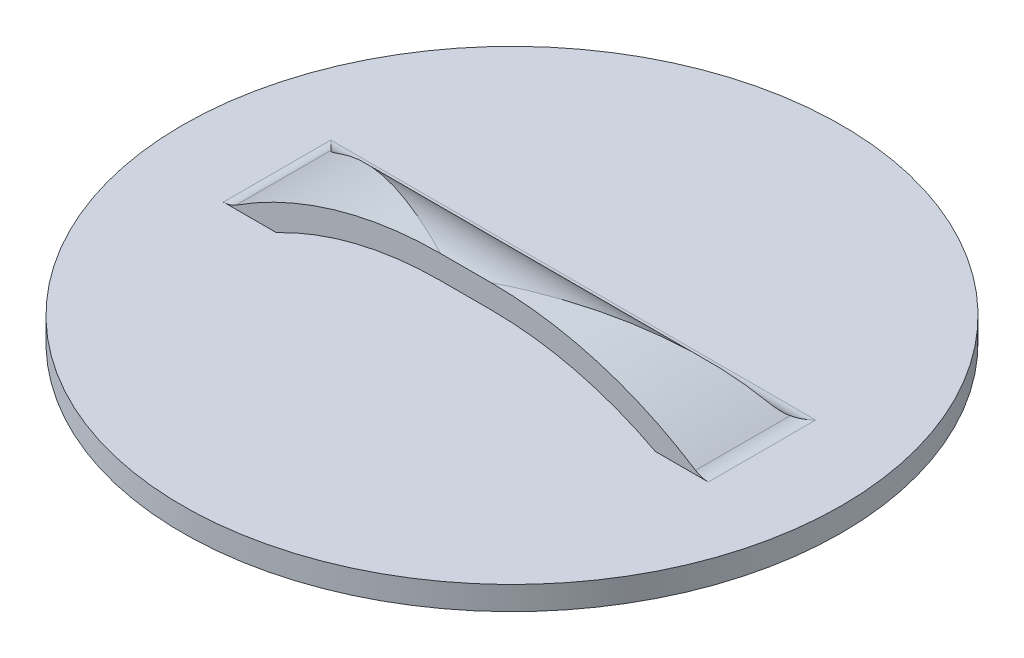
ISO-10303-21;
HEADER;
FILE_DESCRIPTION(('STEP AP214'),'2;1');
FILE_NAME('part.step','',(''),(''),'','','');
FILE_SCHEMA(('AUTOMOTIVE_DESIGN { 1 0 10303 214 1 1 1 1 }'));
ENDSEC;
DATA;
#1=APPLICATION_CONTEXT('core data for automotive mechanical design processes');
#2=APPLICATION_PROTOCOL_DEFINITION('international standard','automotive_design',2000,#1);
#3=PRODUCT_CONTEXT('',#1,'mechanical');
#4=PRODUCT('Part','Part','',(#3));
#5=PRODUCT_RELATED_PRODUCT_CATEGORY('part','',(#4));
#6=PRODUCT_DEFINITION_FORMATION('','',#4);
#7=PRODUCT_DEFINITION_CONTEXT('part definition',#1,'design');
#8=PRODUCT_DEFINITION('design','',#6,#7);
#9=PRODUCT_DEFINITION_SHAPE('','',#8);
#10=(LENGTH_UNIT() NAMED_UNIT(*) SI_UNIT(.MILLI.,.METRE.));
#11=(NAMED_UNIT(*) PLANE_ANGLE_UNIT() SI_UNIT($,.RADIAN.));
#12=(NAMED_UNIT(*) SI_UNIT($,.STERADIAN.) SOLID_ANGLE_UNIT());
#13=UNCERTAINTY_MEASURE_WITH_UNIT(LENGTH_MEASURE(1.E-05),#10,'distance_accuracy_value','');
#14=(GEOMETRIC_REPRESENTATION_CONTEXT(3) GLOBAL_UNCERTAINTY_ASSIGNED_CONTEXT((#13)) GLOBAL_UNIT_ASSIGNED_CONTEXT((#10,
#11,#12)) REPRESENTATION_CONTEXT('',''));
#15=CARTESIAN_POINT('',(0.,0.,0.));
#16=DIRECTION('',(0.,0.,1.));
#17=DIRECTION('',(1.,0.,0.));
#18=AXIS2_PLACEMENT_3D('',#15,#16,#17);
#19=CARTESIAN_POINT('',(-3.4163,-38.9867681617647,12.7));
#20=DIRECTION('',(0.,0.,-1.));
#21=DIRECTION('',(-1.,0.,0.));
#22=AXIS2_PLACEMENT_3D('',#19,#20,#21);
#23=CYLINDRICAL_SURFACE('',#22,47.6227681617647);
#24=CARTESIAN_POINT('',(-3.4163,-38.9867681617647,12.7));
#25=DIRECTION('',(0.,0.,1.));
#26=DIRECTION('',(1.,0.,0.));
#27=AXIS2_PLACEMENT_3D('',#24,#25,#26);
#28=CIRCLE('',#27,47.6227681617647);
#29=CARTESIAN_POINT('',(-3.4163,8.636,12.7));
#30=VERTEX_POINT('',#29);
#31=CARTESIAN_POINT('',(-25.559320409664,3.17499999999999,12.7));
#32=VERTEX_POINT('',#31);
#33=EDGE_CURVE('E138',#30,#32,#28,.T.);
#34=ORIENTED_EDGE('',*,*,#33,.T.);
#35=DIRECTION('',(0.,0.,-1.));
#36=VECTOR('',#35,1.);
#37=CARTESIAN_POINT('',(-25.559320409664,3.17499999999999,12.7));
#38=LINE('',#37,#36);
#39=CARTESIAN_POINT('',(-25.559320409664,3.175,3.72143443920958));
#40=VERTEX_POINT('',#39);
#41=EDGE_CURVE('E121',#32,#40,#38,.T.);
#42=ORIENTED_EDGE('',*,*,#41,.T.);
#43=CARTESIAN_POINT('',(-30.7651565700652,0.,2.69678471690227));
#44=CARTESIAN_POINT('',(-30.4142280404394,0.246182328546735,2.733123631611));
#45=CARTESIAN_POINT('',(-30.0606087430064,0.487164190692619,2.77792436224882));
#46=CARTESIAN_POINT('',(-29.3487082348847,0.958447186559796,2.8828807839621));
#47=CARTESIAN_POINT('',(-28.9904284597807,1.18875151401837,2.94303184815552));
#48=CARTESIAN_POINT('',(-28.2703423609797,1.63815632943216,3.07702719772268));
#49=CARTESIAN_POINT('',(-27.9085432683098,1.85727563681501,3.15084744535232));
#50=CARTESIAN_POINT('',(-27.1812932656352,2.28466350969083,3.3109146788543));
#51=CARTESIAN_POINT('',(-26.8158420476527,2.49293115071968,3.39716272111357));
#52=CARTESIAN_POINT('',(-25.7183043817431,3.09939298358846,3.67178987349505));
#53=CARTESIAN_POINT('',(-24.9813955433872,3.48151144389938,3.87675323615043));
#54=CARTESIAN_POINT('',(-23.4973314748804,4.20306506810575,4.32289835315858));
#55=CARTESIAN_POINT('',(-22.7501701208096,4.54247336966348,4.56410269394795));
#56=CARTESIAN_POINT('',(-21.3995448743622,5.11487623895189,5.02437412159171));
#57=CARTESIAN_POINT('',(-20.797478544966,5.35552931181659,5.23810071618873));
#58=CARTESIAN_POINT('',(-19.5891702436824,5.81036446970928,5.68151247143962));
#59=CARTESIAN_POINT('',(-18.9829278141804,6.02454360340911,5.91119940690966));
#60=CARTESIAN_POINT('',(-17.7668433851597,6.42688928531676,6.38408175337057));
#61=CARTESIAN_POINT('',(-17.1570002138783,6.615046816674,6.6272818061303));
#62=CARTESIAN_POINT('',(-15.9345852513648,6.96565145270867,7.12489381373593));
#63=CARTESIAN_POINT('',(-15.3220135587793,7.12809947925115,7.37930536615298));
#64=CARTESIAN_POINT('',(-13.4787355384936,7.5779988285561,8.15731188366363));
#65=CARTESIAN_POINT('',(-12.2444548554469,7.82735098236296,8.69489350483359));
#66=CARTESIAN_POINT('',(-9.77102917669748,8.22672684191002,9.79305473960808));
#67=CARTESIAN_POINT('',(-8.53188699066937,8.37680126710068,10.3536224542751));
#68=CARTESIAN_POINT('',(-6.65247035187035,8.53024237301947,11.2115956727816));
#69=CARTESIAN_POINT('',(-6.01302980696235,8.56946067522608,11.5048648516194));
#70=CARTESIAN_POINT('',(-4.73435128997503,8.62205267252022,12.0926740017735));
#71=CARTESIAN_POINT('',(-4.09511372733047,8.63545150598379,12.3872124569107));
#72=CARTESIAN_POINT('',(-3.44272629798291,8.63599450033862,12.6878231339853));
#73=CARTESIAN_POINT('',(-3.42951313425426,8.63599999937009,12.6939115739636));
#74=CARTESIAN_POINT('',(-3.4163,8.636,12.7));
#75=B_SPLINE_CURVE_WITH_KNOTS('',3,(#43,#44,#45,#46,#47,#48,#49,#50,#51,#52,#53,#54,#55,#56,#57,
#58,#59,#60,#61,#62,#63,#64,#65,#66,#67,#68,#69,#70,#71,#72,#73,#74),.UNSPECIFIED.,.F.,.F.,(4,2,
2,2,2,2,2,2,2,2,2,2,2,2,2,4),(0.,1.29039724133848,2.58040599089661,3.86816739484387,
5.15603832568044,7.71878510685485,10.2831357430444,12.3305064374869,14.3781051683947,
16.4264116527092,18.4746446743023,22.5777987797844,26.6788550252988,28.7922085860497,
30.903503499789,30.9471487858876),.UNSPECIFIED.);
#76=EDGE_CURVE('E130',#40,#30,#75,.T.);
#77=ORIENTED_EDGE('',*,*,#76,.T.);
#78=EDGE_LOOP('',(#34,#42,#77));
#79=FACE_BOUND('',#78,.T.);
#80=ADVANCED_FACE('F38',(#79),#23,.F.);
#81=CARTESIAN_POINT('',(3.4163,-38.9867681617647,12.7));
#82=DIRECTION('',(0.,0.,-1.));
#83=DIRECTION('',(-1.,0.,0.));
#84=AXIS2_PLACEMENT_3D('',#81,#82,#83);
#85=CYLINDRICAL_SURFACE('',#84,47.6227681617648);
#86=CARTESIAN_POINT('',(30.7651565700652,0.,2.69678471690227));
#87=CARTESIAN_POINT('',(30.4142280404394,0.246182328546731,2.733123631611));
#88=CARTESIAN_POINT('',(30.0606087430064,0.487164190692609,2.77792436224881));
#89=CARTESIAN_POINT('',(29.3487082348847,0.958447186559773,2.8828807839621));
#90=CARTESIAN_POINT('',(28.9904284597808,1.18875151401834,2.94303184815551));
#91=CARTESIAN_POINT('',(28.2703423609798,1.63815632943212,3.07702719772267));
#92=CARTESIAN_POINT('',(27.9085432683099,1.85727563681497,3.1508474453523));
#93=CARTESIAN_POINT('',(27.1812932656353,2.28466350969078,3.31091467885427));
#94=CARTESIAN_POINT('',(26.8158420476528,2.49293115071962,3.39716272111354));
#95=CARTESIAN_POINT('',(25.7183043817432,3.0993929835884,3.67178987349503));
#96=CARTESIAN_POINT('',(24.9813955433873,3.48151144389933,3.8767532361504));
#97=CARTESIAN_POINT('',(23.4973314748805,4.20306506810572,4.32289835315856));
#98=CARTESIAN_POINT('',(22.7501701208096,4.54247336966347,4.56410269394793));
#99=CARTESIAN_POINT('',(21.3995448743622,5.11487623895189,5.02437412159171));
#100=CARTESIAN_POINT('',(20.797478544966,5.3555293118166,5.23810071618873));
#101=CARTESIAN_POINT('',(19.5891702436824,5.81036446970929,5.68151247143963));
#102=CARTESIAN_POINT('',(18.9829278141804,6.02454360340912,5.91119940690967));
#103=CARTESIAN_POINT('',(17.7668433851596,6.42688928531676,6.38408175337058));
#104=CARTESIAN_POINT('',(17.1570002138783,6.61504681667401,6.62728180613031));
#105=CARTESIAN_POINT('',(15.9345852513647,6.96565145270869,7.12489381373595));
#106=CARTESIAN_POINT('',(15.3220135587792,7.12809947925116,7.379305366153));
#107=CARTESIAN_POINT('',(13.4787355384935,7.5779988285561,8.15731188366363));
#108=CARTESIAN_POINT('',(12.2444548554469,7.82735098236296,8.69489350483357));
#109=CARTESIAN_POINT('',(9.77102917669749,8.22672684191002,9.79305473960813));
#110=CARTESIAN_POINT('',(8.53188699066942,8.37680126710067,10.3536224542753));
#111=CARTESIAN_POINT('',(6.65247035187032,8.53024237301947,11.2115956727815));
#112=CARTESIAN_POINT('',(6.01302980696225,8.56946067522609,11.5048648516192));
#113=CARTESIAN_POINT('',(4.73435128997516,8.62205267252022,12.0926740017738));
#114=CARTESIAN_POINT('',(4.09511372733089,8.63545150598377,12.3872124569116));
#115=CARTESIAN_POINT('',(3.44272629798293,8.63599450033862,12.6878231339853));
#116=CARTESIAN_POINT('',(3.42951313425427,8.6359999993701,12.6939115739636));
#117=CARTESIAN_POINT('',(3.4163,8.636,12.7));
#118=B_SPLINE_CURVE_WITH_KNOTS('',3,(#86,#87,#88,#89,#90,#91,#92,#93,#94,#95,#96,#97,#98,#99,
#100,#101,#102,#103,#104,#105,#106,#107,#108,#109,#110,#111,#112,#113,#114,#115,#116,#117),
.UNSPECIFIED.,.F.,.F.,(4,2,2,2,2,2,2,2,2,2,2,2,2,2,2,4),(0.,1.29039724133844,2.58040599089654,
3.86816739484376,5.1560383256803,7.71878510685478,10.2831357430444,12.3305064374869,
14.3781051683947,16.4264116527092,18.4746446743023,22.5777987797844,26.6788550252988,
28.7922085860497,30.903503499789,30.9471487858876),.UNSPECIFIED.);
#119=CARTESIAN_POINT('',(3.4163,8.636,12.7));
#120=VERTEX_POINT('',#119);
#121=CARTESIAN_POINT('',(25.559320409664,3.175,3.72143443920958));
#122=VERTEX_POINT('',#121);
#123=EDGE_CURVE('E129',#120,#122,#118,.F.);
#124=ORIENTED_EDGE('',*,*,#123,.T.);
#125=DIRECTION('',(0.,0.,-1.));
#126=VECTOR('',#125,1.);
#127=CARTESIAN_POINT('',(25.559320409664,3.175,12.7));
#128=LINE('',#127,#126);
#129=CARTESIAN_POINT('',(25.559320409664,3.175,12.7));
#130=VERTEX_POINT('',#129);
#131=EDGE_CURVE('E110',#122,#130,#128,.F.);
#132=ORIENTED_EDGE('',*,*,#131,.T.);
#133=CARTESIAN_POINT('',(3.4163,-38.9867681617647,12.7));
#134=DIRECTION('',(0.,0.,1.));
#135=DIRECTION('',(-1.,0.,0.));
#136=AXIS2_PLACEMENT_3D('',#133,#134,#135);
#137=CIRCLE('',#136,47.6227681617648);
#138=EDGE_CURVE('E135',#130,#120,#137,.T.);
#139=ORIENTED_EDGE('',*,*,#138,.T.);
#140=EDGE_LOOP('',(#124,#132,#139));
#141=FACE_BOUND('',#140,.T.);
#142=ADVANCED_FACE('F134',(#141),#85,.F.);
#143=CARTESIAN_POINT('',(3.4163,-38.9867681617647,12.7));
#144=DIRECTION('',(0.,0.,-1.));
#145=DIRECTION('',(-1.,0.,0.));
#146=AXIS2_PLACEMENT_3D('',#143,#144,#145);
#147=PLANE('',#146);
#148=DIRECTION('',(-1.,0.,0.));
#149=VECTOR('',#148,1.);
#150=CARTESIAN_POINT('',(3.41629999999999,3.175,12.7));
#151=LINE('',#150,#149);
#152=CARTESIAN_POINT('',(32.7017427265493,3.175,12.7));
#153=VERTEX_POINT('',#152);
#154=EDGE_CURVE('E117',#153,#130,#151,.T.);
#155=ORIENTED_EDGE('',*,*,#154,.F.);
#156=CARTESIAN_POINT('',(32.7017427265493,6.35,12.7));
#157=DIRECTION('',(0.,0.,-1.));
#158=DIRECTION('',(-1.,0.,0.));
#159=AXIS2_PLACEMENT_3D('',#156,#157,#158);
#160=CIRCLE('',#159,3.175);
#161=CARTESIAN_POINT('',(30.9789983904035,3.68302100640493,12.7));
#162=VERTEX_POINT('',#161);
#163=EDGE_CURVE('E12',#153,#162,#160,.T.);
#164=ORIENTED_EDGE('',*,*,#163,.T.);
#165=CARTESIAN_POINT('',(3.4163,-38.9867681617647,12.7));
#166=DIRECTION('',(0.,0.,1.));
#167=DIRECTION('',(-1.,0.,0.));
#168=AXIS2_PLACEMENT_3D('',#165,#166,#167);
#169=CIRCLE('',#168,50.7977681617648);
#170=CARTESIAN_POINT('',(3.4163,11.811,12.7));
#171=VERTEX_POINT('',#170);
#172=EDGE_CURVE('E390',#162,#171,#169,.T.);
#173=ORIENTED_EDGE('',*,*,#172,.T.);
#174=DIRECTION('',(-1.,0.,0.));
#175=VECTOR('',#174,1.);
#176=CARTESIAN_POINT('',(-3.4163,11.811,12.7));
#177=LINE('',#176,#175);
#178=CARTESIAN_POINT('',(-3.4163,11.811,12.7));
#179=VERTEX_POINT('',#178);
#180=EDGE_CURVE('E392',#171,#179,#177,.T.);
#181=ORIENTED_EDGE('',*,*,#180,.T.);
#182=CARTESIAN_POINT('',(-3.4163,-38.9867681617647,12.7));
#183=DIRECTION('',(0.,0.,1.));
#184=DIRECTION('',(1.,0.,0.));
#185=AXIS2_PLACEMENT_3D('',#182,#183,#184);
#186=CIRCLE('',#185,50.7977681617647);
#187=CARTESIAN_POINT('',(-30.9789983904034,3.68302100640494,12.7));
#188=VERTEX_POINT('',#187);
#189=EDGE_CURVE('E237',#179,#188,#186,.T.);
#190=ORIENTED_EDGE('',*,*,#189,.T.);
#191=CARTESIAN_POINT('',(-32.7017427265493,6.35,12.7));
#192=DIRECTION('',(0.,0.,-1.));
#193=DIRECTION('',(-1.,0.,0.));
#194=AXIS2_PLACEMENT_3D('',#191,#192,#193);
#195=CIRCLE('',#194,3.175);
#196=CARTESIAN_POINT('',(-32.7017427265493,3.175,12.7));
#197=VERTEX_POINT('',#196);
#198=EDGE_CURVE('E188',#188,#197,#195,.T.);
#199=ORIENTED_EDGE('',*,*,#198,.T.);
#200=EDGE_CURVE('E140',#32,#197,#151,.T.);
#201=ORIENTED_EDGE('',*,*,#200,.F.);
#202=ORIENTED_EDGE('',*,*,#33,.F.);
#203=DIRECTION('',(-1.,0.,0.));
#204=VECTOR('',#203,1.);
#205=CARTESIAN_POINT('',(-3.4163,8.636,12.7));
#206=LINE('',#205,#204);
#207=EDGE_CURVE('E393',#120,#30,#206,.T.);
#208=ORIENTED_EDGE('',*,*,#207,.F.);
#209=ORIENTED_EDGE('',*,*,#138,.F.);
#210=EDGE_LOOP('',(#155,#164,#173,#181,#190,#199,#201,#202,#208,#209));
#211=FACE_BOUND('',#210,.T.);
#212=ADVANCED_FACE('F160',(#211),#147,.F.);
#213=CARTESIAN_POINT('',(31.75,-1.47544117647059,12.7));
#214=DIRECTION('',(-1.,0.,0.));
#215=DIRECTION('',(0.,0.,1.));
#216=AXIS2_PLACEMENT_3D('',#213,#214,#215);
#217=CYLINDRICAL_SURFACE('',#216,10.1114411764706);
#218=DIRECTION('',(-1.,0.,0.));
#219=VECTOR('',#218,1.);
#220=CARTESIAN_POINT('',(31.75,3.175,3.72143443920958));
#221=LINE('',#220,#219);
#222=EDGE_CURVE('E114',#122,#40,#221,.T.);
#223=ORIENTED_EDGE('',*,*,#222,.F.);
#224=ORIENTED_EDGE('',*,*,#123,.F.);
#225=ORIENTED_EDGE('',*,*,#207,.T.);
#226=ORIENTED_EDGE('',*,*,#76,.F.);
#227=EDGE_LOOP('',(#223,#224,#225,#226));
#228=FACE_BOUND('',#227,.T.);
#229=ADVANCED_FACE('F127',(#228),#217,.F.);
#230=CARTESIAN_POINT('',(3.4163,-38.9867681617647,12.7));
#231=DIRECTION('',(0.,0.,-1.));
#232=DIRECTION('',(-1.,0.,0.));
#233=AXIS2_PLACEMENT_3D('',#230,#231,#232);
#234=CYLINDRICAL_SURFACE('',#233,50.7977681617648);
#235=ORIENTED_EDGE('',*,*,#172,.F.);
#236=DIRECTION('',(0.,0.,-1.));
#237=VECTOR('',#236,1.);
#238=CARTESIAN_POINT('',(30.9789983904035,3.68302100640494,12.7));
#239=LINE('',#238,#237);
#240=CARTESIAN_POINT('',(30.9789983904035,3.68302100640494,-0.0597111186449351));
#241=VERTEX_POINT('',#240);
#242=EDGE_CURVE('E55',#162,#241,#239,.T.);
#243=ORIENTED_EDGE('',*,*,#242,.T.);
#244=CARTESIAN_POINT('',(30.9789983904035,3.68302100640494,-0.0597111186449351));
#245=CARTESIAN_POINT('',(30.935202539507,3.71131158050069,-0.0159221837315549));
#246=CARTESIAN_POINT('',(30.890362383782,3.7401801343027,0.0264112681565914));
#247=CARTESIAN_POINT('',(30.7988583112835,3.79888008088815,0.108299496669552));
#248=CARTESIAN_POINT('',(30.7521952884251,3.82871100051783,0.147855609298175));
#249=CARTESIAN_POINT('',(30.6100233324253,3.91925995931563,0.262440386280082));
#250=CARTESIAN_POINT('',(30.5121265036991,3.98116682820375,0.333586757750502));
#251=CARTESIAN_POINT('',(30.3128310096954,4.10619582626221,0.465683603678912));
#252=CARTESIAN_POINT('',(30.2114947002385,4.16929156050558,0.526754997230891));
#253=CARTESIAN_POINT('',(30.0050870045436,4.29676662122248,0.640800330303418));
#254=CARTESIAN_POINT('',(29.900013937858,4.3611465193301,0.693770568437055));
#255=CARTESIAN_POINT('',(29.6808943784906,4.49428132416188,0.795206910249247));
#256=CARTESIAN_POINT('',(29.5666771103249,4.56307710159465,0.84324655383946));
#257=CARTESIAN_POINT('',(29.3347838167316,4.70149020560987,0.93228275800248));
#258=CARTESIAN_POINT('',(29.2170889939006,4.771109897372,0.973226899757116));
#259=CARTESIAN_POINT('',(29.0983767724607,4.84066825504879,1.01084773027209));
#260=B_SPLINE_CURVE_WITH_KNOTS('',3,(#244,#245,#246,#247,#248,#249,#250,#251,#252,#253,#254,
#255,#256,#257,#258,#259),.UNSPECIFIED.,.F.,.F.,(4,2,2,2,2,2,2,4),(0.,0.204197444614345,
0.408295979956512,0.815547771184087,1.21748594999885,1.61960722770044,2.04455869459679,
2.47252683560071),.UNSPECIFIED.);
#261=CARTESIAN_POINT('',(29.0983767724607,4.84066825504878,1.01084773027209));
#262=VERTEX_POINT('',#261);
#263=EDGE_CURVE('E47',#241,#262,#260,.T.);
#264=ORIENTED_EDGE('',*,*,#263,.T.);
#265=CARTESIAN_POINT('',(39.661955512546,-3.39652080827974,-0.446823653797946));
#266=CARTESIAN_POINT('',(39.4069543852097,-3.13680823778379,-0.48476449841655));
#267=CARTESIAN_POINT('',(39.1485869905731,-2.87928125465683,-0.51454597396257));
#268=CARTESIAN_POINT('',(38.6257600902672,-2.36928327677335,-0.558812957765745));
#269=CARTESIAN_POINT('',(38.3613023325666,-2.11681086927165,-0.573302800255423));
#270=CARTESIAN_POINT('',(37.8271086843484,-1.61775671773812,-0.588020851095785));
#271=CARTESIAN_POINT('',(37.5573794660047,-1.3711683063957,-0.588266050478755));
#272=CARTESIAN_POINT('',(37.0128377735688,-0.884020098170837,-0.575507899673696));
#273=CARTESIAN_POINT('',(36.7380249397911,-0.643460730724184,-0.562503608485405));
#274=CARTESIAN_POINT('',(35.9106748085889,0.065162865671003,-0.505289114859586));
#275=CARTESIAN_POINT('',(35.3512746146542,0.523861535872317,-0.442956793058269));
#276=CARTESIAN_POINT('',(34.2174725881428,1.41398327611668,-0.276354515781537));
#277=CARTESIAN_POINT('',(33.6430715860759,1.84540785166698,-0.172086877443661));
#278=CARTESIAN_POINT('',(32.8454286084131,2.41867999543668,-0.00400513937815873));
#279=CARTESIAN_POINT('',(32.6275000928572,2.57270716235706,0.0442618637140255));
#280=CARTESIAN_POINT('',(32.1899773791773,2.87681678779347,0.14559631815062));
#281=CARTESIAN_POINT('',(31.9703829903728,3.02689878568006,0.198664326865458));
#282=CARTESIAN_POINT('',(30.8435338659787,3.78416105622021,0.481603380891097));
#283=CARTESIAN_POINT('',(29.9237262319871,4.35981137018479,0.747570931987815));
#284=CARTESIAN_POINT('',(28.0638677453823,5.44375407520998,1.34058361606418));
#285=CARTESIAN_POINT('',(27.1237995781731,5.95198596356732,1.66768298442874));
#286=CARTESIAN_POINT('',(25.224935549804,6.90362753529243,2.37177467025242));
#287=CARTESIAN_POINT('',(24.2660832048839,7.34679006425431,2.74894735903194));
#288=CARTESIAN_POINT('',(22.3368884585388,8.16748318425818,3.54199444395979));
#289=CARTESIAN_POINT('',(21.366548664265,8.54502837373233,3.95786020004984));
#290=CARTESIAN_POINT('',(19.2342789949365,9.30104343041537,4.90081302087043));
#291=CARTESIAN_POINT('',(18.0704837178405,9.66645917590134,5.43414826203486));
#292=CARTESIAN_POINT('',(15.733519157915,10.3099735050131,6.53244926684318));
#293=CARTESIAN_POINT('',(14.5603474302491,10.58804849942,7.09742352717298));
#294=CARTESIAN_POINT('',(12.2101755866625,11.0583541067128,8.2481420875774));
#295=CARTESIAN_POINT('',(11.0331880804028,11.2507578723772,8.83384188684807));
#296=CARTESIAN_POINT('',(8.67575314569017,11.551957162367,10.0186167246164));
#297=CARTESIAN_POINT('',(7.49530721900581,11.6607847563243,10.6176865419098));
#298=CARTESIAN_POINT('',(5.83803122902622,11.7554815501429,11.4623304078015));
#299=CARTESIAN_POINT('',(5.36172750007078,11.7759711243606,11.7054975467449));
#300=CARTESIAN_POINT('',(4.40908571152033,11.8035324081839,12.1922703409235));
#301=CARTESIAN_POINT('',(3.93274769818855,11.810607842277,12.4358758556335));
#302=CARTESIAN_POINT('',(3.44305516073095,11.8109947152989,12.6863167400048));
#303=CARTESIAN_POINT('',(3.42967757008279,11.8109999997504,12.6931583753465));
#304=CARTESIAN_POINT('',(3.4163,11.811,12.7));
#305=B_SPLINE_CURVE_WITH_KNOTS('',3,(#265,#266,#267,#268,#269,#270,#271,#272,#273,#274,#275,
#276,#277,#278,#279,#280,#281,#282,#283,#284,#285,#286,#287,#288,#289,#290,#291,#292,#293,#294,
#295,#296,#297,#298,#299,#300,#301,#302,#303,#304),.UNSPECIFIED.,.F.,.F.,(4,2,2,2,2,2,2,2,2,2,2,
2,2,2,2,2,2,2,2,4),(0.,1.09764628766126,2.19498137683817,3.29100753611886,4.38711154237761,
6.56314988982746,8.73906801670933,9.55259510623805,10.3662167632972,13.712756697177,
17.0622798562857,20.4242135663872,23.7853983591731,27.7757152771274,31.7671089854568,
35.7503985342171,39.732158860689,41.3375788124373,42.9425529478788,42.987629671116),.UNSPECIFIED.);
#306=EDGE_CURVE('E132',#171,#262,#305,.F.);
#307=ORIENTED_EDGE('',*,*,#306,.F.);
#308=EDGE_LOOP('',(#235,#243,#264,#307));
#309=FACE_BOUND('',#308,.T.);
#310=ADVANCED_FACE('F176',(#309),#234,.T.);
#311=CARTESIAN_POINT('',(-3.4163,-38.9867681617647,12.7));
#312=DIRECTION('',(0.,0.,-1.));
#313=DIRECTION('',(-1.,0.,0.));
#314=AXIS2_PLACEMENT_3D('',#311,#312,#313);
#315=CYLINDRICAL_SURFACE('',#314,50.7977681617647);
#316=CARTESIAN_POINT('',(-39.6619555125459,-3.39652080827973,-0.446823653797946));
#317=CARTESIAN_POINT('',(-39.4069543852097,-3.13680823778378,-0.484764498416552));
#318=CARTESIAN_POINT('',(-39.148586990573,-2.87928125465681,-0.514545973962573));
#319=CARTESIAN_POINT('',(-38.6257600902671,-2.36928327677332,-0.558812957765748));
#320=CARTESIAN_POINT('',(-38.3613023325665,-2.11681086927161,-0.573302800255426));
#321=CARTESIAN_POINT('',(-37.8271086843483,-1.61775671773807,-0.588020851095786));
#322=CARTESIAN_POINT('',(-37.5573794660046,-1.37116830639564,-0.588266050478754));
#323=CARTESIAN_POINT('',(-37.0128377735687,-0.884020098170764,-0.575507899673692));
#324=CARTESIAN_POINT('',(-36.7380249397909,-0.643460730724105,-0.562503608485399));
#325=CARTESIAN_POINT('',(-35.9106748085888,0.0651628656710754,-0.505289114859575));
#326=CARTESIAN_POINT('',(-35.3512746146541,0.523861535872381,-0.442956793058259));
#327=CARTESIAN_POINT('',(-34.2174725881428,1.41398327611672,-0.276354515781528));
#328=CARTESIAN_POINT('',(-33.6430715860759,1.84540785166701,-0.172086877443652));
#329=CARTESIAN_POINT('',(-32.8454286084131,2.41867999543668,-0.00400513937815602));
#330=CARTESIAN_POINT('',(-32.6275000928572,2.57270716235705,0.0442618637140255));
#331=CARTESIAN_POINT('',(-32.1899773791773,2.87681678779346,0.145596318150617));
#332=CARTESIAN_POINT('',(-31.9703829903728,3.02689878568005,0.198664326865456));
#333=CARTESIAN_POINT('',(-30.8435338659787,3.78416105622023,0.481603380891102));
#334=CARTESIAN_POINT('',(-29.9237262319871,4.3598113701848,0.747570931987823));
#335=CARTESIAN_POINT('',(-28.0638677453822,5.44375407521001,1.3405836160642));
#336=CARTESIAN_POINT('',(-27.123799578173,5.95198596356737,1.66768298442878));
#337=CARTESIAN_POINT('',(-25.2249355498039,6.90362753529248,2.37177467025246));
#338=CARTESIAN_POINT('',(-24.2660832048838,7.34679006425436,2.74894735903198));
#339=CARTESIAN_POINT('',(-22.3368884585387,8.16748318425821,3.54199444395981));
#340=CARTESIAN_POINT('',(-21.366548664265,8.54502837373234,3.95786020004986));
#341=CARTESIAN_POINT('',(-19.2342789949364,9.30104343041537,4.90081302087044));
#342=CARTESIAN_POINT('',(-18.0704837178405,9.66645917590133,5.43414826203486));
#343=CARTESIAN_POINT('',(-15.7335191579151,10.3099735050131,6.53244926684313));
#344=CARTESIAN_POINT('',(-14.5603474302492,10.5880484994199,7.09742352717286));
#345=CARTESIAN_POINT('',(-12.2101755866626,11.0583541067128,8.24814208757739));
#346=CARTESIAN_POINT('',(-11.033188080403,11.2507578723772,8.83384188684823));
#347=CARTESIAN_POINT('',(-8.67575314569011,11.551957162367,10.0186167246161));
#348=CARTESIAN_POINT('',(-7.49530721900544,11.6607847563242,10.617686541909));
#349=CARTESIAN_POINT('',(-5.83803122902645,11.7554815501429,11.4623304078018));
#350=CARTESIAN_POINT('',(-5.36172750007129,11.7759711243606,11.7054975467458));
#351=CARTESIAN_POINT('',(-4.40908571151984,11.8035324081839,12.1922703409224));
#352=CARTESIAN_POINT('',(-3.93274769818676,11.8106078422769,12.4358758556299));
#353=CARTESIAN_POINT('',(-3.44305516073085,11.8109947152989,12.6863167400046));
#354=CARTESIAN_POINT('',(-3.42967757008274,11.8109999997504,12.6931583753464));
#355=CARTESIAN_POINT('',(-3.4163,11.811,12.7));
#356=B_SPLINE_CURVE_WITH_KNOTS('',3,(#316,#317,#318,#319,#320,#321,#322,#323,#324,#325,#326,
#327,#328,#329,#330,#331,#332,#333,#334,#335,#336,#337,#338,#339,#340,#341,#342,#343,#344,#345,
#346,#347,#348,#349,#350,#351,#352,#353,#354,#355),.UNSPECIFIED.,.F.,.F.,(4,2,2,2,2,2,2,2,2,2,2,
2,2,2,2,2,2,2,2,4),(0.,1.09764628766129,2.19498137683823,3.29100753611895,4.38711154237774,
6.56314988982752,8.73906801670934,9.55259510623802,10.3662167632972,13.712756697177,
17.0622798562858,20.4242135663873,23.7853983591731,27.7757152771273,31.7671089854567,
35.750398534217,39.7321588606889,41.3375788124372,42.9425529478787,42.987629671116),.UNSPECIFIED.);
#357=CARTESIAN_POINT('',(-29.0983767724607,4.84066825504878,1.01084773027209));
#358=VERTEX_POINT('',#357);
#359=EDGE_CURVE('E214',#179,#358,#356,.F.);
#360=ORIENTED_EDGE('',*,*,#359,.T.);
#361=CARTESIAN_POINT('',(-29.0983767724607,4.84066825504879,1.01084773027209));
#362=CARTESIAN_POINT('',(-29.1656416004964,4.80125248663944,0.989547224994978));
#363=CARTESIAN_POINT('',(-29.2325593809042,4.76183159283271,0.96717152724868));
#364=CARTESIAN_POINT('',(-29.3656300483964,4.6830326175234,0.920127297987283));
#365=CARTESIAN_POINT('',(-29.4317827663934,4.64365454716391,0.895458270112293));
#366=CARTESIAN_POINT('',(-29.6293898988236,4.52542279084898,0.817636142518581));
#367=CARTESIAN_POINT('',(-29.7595351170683,4.44674018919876,0.760810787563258));
#368=CARTESIAN_POINT('',(-30.0125653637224,4.29225025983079,0.637433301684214));
#369=CARTESIAN_POINT('',(-30.1355452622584,4.21641720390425,0.571109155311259));
#370=CARTESIAN_POINT('',(-30.3755384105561,4.06706584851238,0.426531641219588));
#371=CARTESIAN_POINT('',(-30.4925613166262,3.99354388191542,0.348298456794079));
#372=CARTESIAN_POINT('',(-30.6706668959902,3.88068655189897,0.214342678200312));
#373=CARTESIAN_POINT('',(-30.7343908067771,3.84009925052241,0.163180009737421));
#374=CARTESIAN_POINT('',(-30.8590468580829,3.76033044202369,0.0556747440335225));
#375=CARTESIAN_POINT('',(-30.9199603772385,3.72115860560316,-0.000696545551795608));
#376=CARTESIAN_POINT('',(-30.9789983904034,3.68302100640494,-0.0597111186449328));
#377=B_SPLINE_CURVE_WITH_KNOTS('',3,(#361,#362,#363,#364,#365,#366,#367,#368,#369,#370,#371,
#372,#373,#374,#375,#376),.UNSPECIFIED.,.F.,.F.,(4,2,2,2,2,2,2,4),(0.,0.242443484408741,
0.484939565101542,0.971578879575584,1.44805253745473,1.92372748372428,2.19728321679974,
2.47244765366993),.UNSPECIFIED.);
#378=CARTESIAN_POINT('',(-30.9789983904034,3.68302100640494,-0.0597111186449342));
#379=VERTEX_POINT('',#378);
#380=EDGE_CURVE('E181',#358,#379,#377,.T.);
#381=ORIENTED_EDGE('',*,*,#380,.T.);
#382=DIRECTION('',(0.,0.,-1.));
#383=VECTOR('',#382,1.);
#384=CARTESIAN_POINT('',(-30.9789983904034,3.68302100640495,12.7));
#385=LINE('',#384,#383);
#386=EDGE_CURVE('E63',#379,#188,#385,.F.);
#387=ORIENTED_EDGE('',*,*,#386,.T.);
#388=ORIENTED_EDGE('',*,*,#189,.F.);
#389=EDGE_LOOP('',(#360,#381,#387,#388));
#390=FACE_BOUND('',#389,.T.);
#391=ADVANCED_FACE('F172',(#390),#315,.T.);
#392=CARTESIAN_POINT('',(-44.45,0.,12.7));
#393=DIRECTION('',(0.,1.,0.));
#394=DIRECTION('',(-1.,0.,0.));
#395=AXIS2_PLACEMENT_3D('',#392,#393,#394);
#396=PLANE('',#395);
#397=CARTESIAN_POINT('',(0.,0.,6.477));
#398=DIRECTION('',(0.,-1.,0.));
#399=DIRECTION('',(1.,0.,0.));
#400=AXIS2_PLACEMENT_3D('',#397,#398,#399);
#401=CIRCLE('',#400,44.45);
#402=CARTESIAN_POINT('',(44.45,0.,6.477));
#403=VERTEX_POINT('',#402);
#404=EDGE_CURVE('E243',#403,#403,#401,.T.);
#405=ORIENTED_EDGE('',*,*,#404,.T.);
#406=EDGE_LOOP('',(#405));
#407=FACE_BOUND('',#406,.T.);
#408=ADVANCED_FACE('F171',(#407),#396,.F.);
#409=CARTESIAN_POINT('',(-44.45,3.175,12.7));
#410=DIRECTION('',(0.,-1.,0.));
#411=DIRECTION('',(0.,0.,-1.));
#412=AXIS2_PLACEMENT_3D('',#409,#410,#411);
#413=PLANE('',#412);
#414=ORIENTED_EDGE('',*,*,#200,.T.);
#415=DIRECTION('',(0.,0.,1.));
#416=VECTOR('',#415,1.);
#417=CARTESIAN_POINT('',(-32.7017427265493,3.175,0.254000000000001));
#418=LINE('',#417,#416);
#419=CARTESIAN_POINT('',(-32.7017427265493,3.175,-1.78245545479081));
#420=VERTEX_POINT('',#419);
#421=EDGE_CURVE('E225',#197,#420,#418,.F.);
#422=ORIENTED_EDGE('',*,*,#421,.T.);
#423=DIRECTION('',(1.,0.,0.));
#424=VECTOR('',#423,1.);
#425=CARTESIAN_POINT('',(31.75,3.175,-1.78245545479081));
#426=LINE('',#425,#424);
#427=CARTESIAN_POINT('',(32.7017427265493,3.175,-1.78245545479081));
#428=VERTEX_POINT('',#427);
#429=EDGE_CURVE('E223',#420,#428,#426,.T.);
#430=ORIENTED_EDGE('',*,*,#429,.T.);
#431=DIRECTION('',(0.,0.,1.));
#432=VECTOR('',#431,1.);
#433=CARTESIAN_POINT('',(32.7017427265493,3.175,12.7));
#434=LINE('',#433,#432);
#435=EDGE_CURVE('E131',#428,#153,#434,.T.);
#436=ORIENTED_EDGE('',*,*,#435,.T.);
#437=ORIENTED_EDGE('',*,*,#154,.T.);
#438=ORIENTED_EDGE('',*,*,#131,.F.);
#439=ORIENTED_EDGE('',*,*,#222,.T.);
#440=ORIENTED_EDGE('',*,*,#41,.F.);
#441=EDGE_LOOP('',(#414,#422,#430,#436,#437,#438,#439,#440));
#442=FACE_BOUND('',#441,.T.);
#443=CARTESIAN_POINT('',(0.,3.17499999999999,6.477));
#444=DIRECTION('',(0.,-1.,0.));
#445=DIRECTION('',(1.,0.,0.));
#446=AXIS2_PLACEMENT_3D('',#443,#444,#445);
#447=CIRCLE('',#446,44.45);
#448=CARTESIAN_POINT('',(44.45,3.175,6.477));
#449=VERTEX_POINT('',#448);
#450=EDGE_CURVE('E122',#449,#449,#447,.T.);
#451=ORIENTED_EDGE('',*,*,#450,.F.);
#452=EDGE_LOOP('',(#451));
#453=FACE_BOUND('',#452,.T.);
#454=ADVANCED_FACE('F112',(#442,#453),#413,.F.);
#455=CARTESIAN_POINT('',(44.45,-1.47544117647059,12.7));
#456=DIRECTION('',(-1.,0.,0.));
#457=DIRECTION('',(0.,0.,1.));
#458=AXIS2_PLACEMENT_3D('',#455,#456,#457);
#459=CYLINDRICAL_SURFACE('',#458,13.2864411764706);
#460=ORIENTED_EDGE('',*,*,#306,.T.);
#461=DIRECTION('',(-1.,0.,0.));
#462=VECTOR('',#461,1.);
#463=CARTESIAN_POINT('',(44.45,4.84066825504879,1.01084773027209));
#464=LINE('',#463,#462);
#465=EDGE_CURVE('E229',#262,#358,#464,.T.);
#466=ORIENTED_EDGE('',*,*,#465,.T.);
#467=ORIENTED_EDGE('',*,*,#359,.F.);
#468=ORIENTED_EDGE('',*,*,#180,.F.);
#469=EDGE_LOOP('',(#460,#466,#467,#468));
#470=FACE_BOUND('',#469,.T.);
#471=ADVANCED_FACE('F161',(#470),#459,.T.);
#472=CARTESIAN_POINT('',(0.,3.17499999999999,6.477));
#473=DIRECTION('',(0.,-1.,0.));
#474=DIRECTION('',(1.,0.,0.));
#475=AXIS2_PLACEMENT_3D('',#472,#473,#474);
#476=CYLINDRICAL_SURFACE('',#475,44.45);
#477=ORIENTED_EDGE('',*,*,#450,.T.);
#478=EDGE_LOOP('',(#477));
#479=FACE_BOUND('',#478,.T.);
#480=ORIENTED_EDGE('',*,*,#404,.F.);
#481=EDGE_LOOP('',(#480));
#482=FACE_BOUND('',#481,.T.);
#483=ADVANCED_FACE('F249',(#479,#482),#476,.T.);
#484=CARTESIAN_POINT('',(32.7017427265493,6.35,12.7));
#485=DIRECTION('',(0.,0.,-1.));
#486=DIRECTION('',(-1.,0.,0.));
#487=AXIS2_PLACEMENT_3D('',#484,#485,#486);
#488=CYLINDRICAL_SURFACE('',#487,3.175);
#489=ORIENTED_EDGE('',*,*,#163,.F.);
#490=ORIENTED_EDGE('',*,*,#435,.F.);
#491=CARTESIAN_POINT('',(32.7017427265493,6.35,-1.78245545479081));
#492=DIRECTION('',(-0.707106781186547,0.,-0.707106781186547));
#493=DIRECTION('',(0.707106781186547,0.,-0.707106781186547));
#494=AXIS2_PLACEMENT_3D('',#491,#492,#493);
#495=ELLIPSE('',#494,4.49012806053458,3.175);
#496=EDGE_CURVE('E42',#241,#428,#495,.F.);
#497=ORIENTED_EDGE('',*,*,#496,.F.);
#498=ORIENTED_EDGE('',*,*,#242,.F.);
#499=EDGE_LOOP('',(#489,#490,#497,#498));
#500=FACE_BOUND('',#499,.T.);
#501=ADVANCED_FACE('F40',(#500),#488,.F.);
#502=CARTESIAN_POINT('',(44.45,6.35,-1.78245545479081));
#503=DIRECTION('',(-1.,0.,0.));
#504=DIRECTION('',(0.,0.,1.));
#505=AXIS2_PLACEMENT_3D('',#502,#503,#504);
#506=CYLINDRICAL_SURFACE('',#505,3.175);
#507=ORIENTED_EDGE('',*,*,#496,.T.);
#508=ORIENTED_EDGE('',*,*,#429,.F.);
#509=CARTESIAN_POINT('',(-32.7017427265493,6.35,-1.78245545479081));
#510=DIRECTION('',(-0.707106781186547,0.,0.707106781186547));
#511=DIRECTION('',(-0.707106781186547,0.,-0.707106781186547));
#512=AXIS2_PLACEMENT_3D('',#509,#510,#511);
#513=ELLIPSE('',#512,4.49012806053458,3.175);
#514=EDGE_CURVE('E239',#379,#420,#513,.F.);
#515=ORIENTED_EDGE('',*,*,#514,.F.);
#516=ORIENTED_EDGE('',*,*,#380,.F.);
#517=ORIENTED_EDGE('',*,*,#465,.F.);
#518=ORIENTED_EDGE('',*,*,#263,.F.);
#519=EDGE_LOOP('',(#507,#508,#515,#516,#517,#518));
#520=FACE_BOUND('',#519,.T.);
#521=ADVANCED_FACE('F194',(#520),#506,.F.);
#522=CARTESIAN_POINT('',(-32.7017427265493,6.35,12.7));
#523=DIRECTION('',(0.,0.,-1.));
#524=DIRECTION('',(-1.,0.,0.));
#525=AXIS2_PLACEMENT_3D('',#522,#523,#524);
#526=CYLINDRICAL_SURFACE('',#525,3.175);
#527=ORIENTED_EDGE('',*,*,#198,.F.);
#528=ORIENTED_EDGE('',*,*,#386,.F.);
#529=ORIENTED_EDGE('',*,*,#514,.T.);
#530=ORIENTED_EDGE('',*,*,#421,.F.);
#531=EDGE_LOOP('',(#527,#528,#529,#530));
#532=FACE_BOUND('',#531,.T.);
#533=ADVANCED_FACE('F198',(#532),#526,.F.);
#534=CLOSED_SHELL('',(#80,#142,#212,#229,#310,#391,#408,#454,#471,#483,#501,#521,#533));
#535=MANIFOLD_SOLID_BREP('B2',#534);
#536=ADVANCED_BREP_SHAPE_REPRESENTATION('',(#18,#535),#14);
#537=SHAPE_DEFINITION_REPRESENTATION(#9,#536);
ENDSEC;
END-ISO-10303-21;
